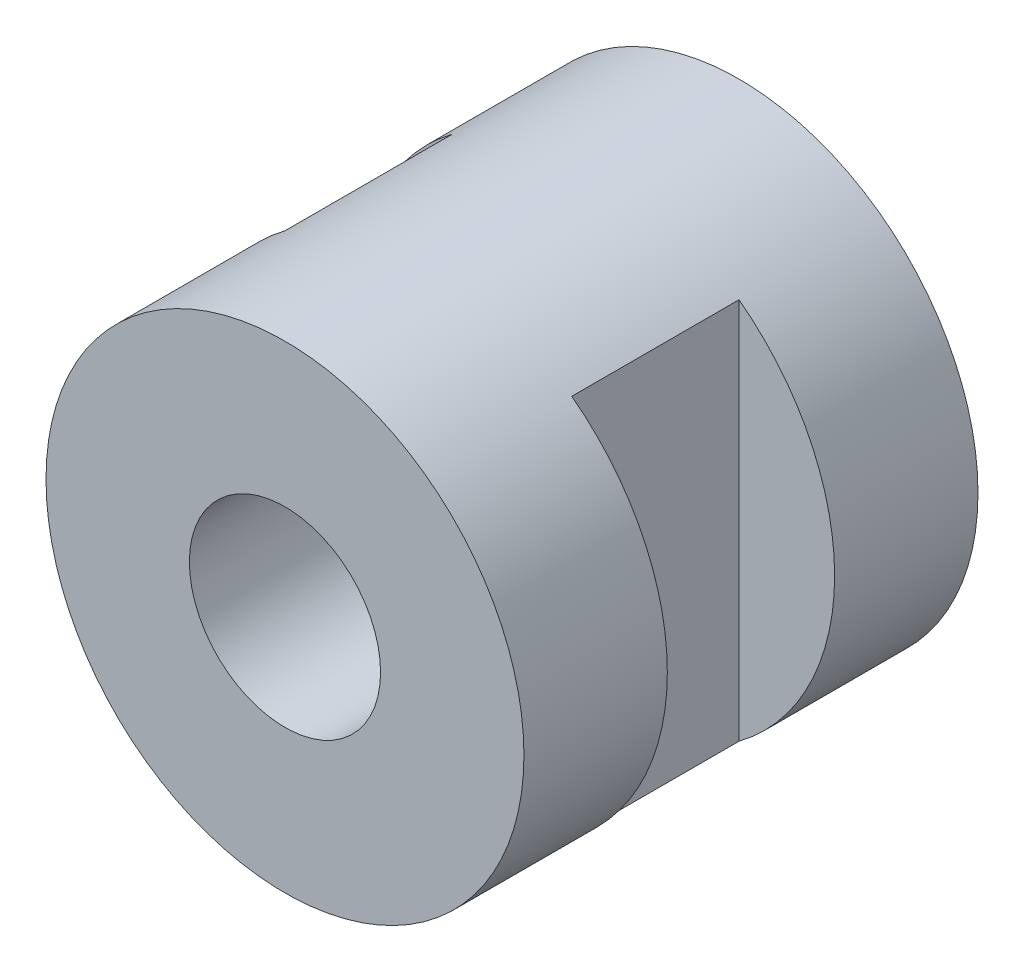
from build123d import *

# Parameters (mm, degrees)
SKETCH_1_R          = 5
EXTRUDE_1_DEPTH     = 9.5
SKETCH_2_W          = 2.383664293
SKETCH_2_H          = 3.5
CUT_EXTRUDE_1_DEPTH = 19.445866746
SKETCH_3_R          = 2
CUT_EXTRUDE_2_DEPTH = 12.842719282


with BuildPart() as part:
    # Sketch 1 → Extrude 1 (new body)
    with BuildSketch(Plane.XY):
        Circle(SKETCH_1_R)
    extrude(amount=EXTRUDE_1_DEPTH)

    # Sketch 2 → Cut-Extrude 1 (cut, through all)
    with BuildSketch(Plane(origin=(0, 10, 0), x_dir=(-1, 0, 0), z_dir=(0, 1, 0))):
        with Locations((-4.191832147, 4.75)):
            Rectangle(SKETCH_2_W, SKETCH_2_H)
        with Locations((4.191832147, 4.75)):
            Rectangle(SKETCH_2_W, SKETCH_2_H)
    extrude(amount=-CUT_EXTRUDE_1_DEPTH, mode=Mode.SUBTRACT)

    # Sketch 3 → Cut-Extrude 2 (cut, through all)
    with BuildSketch(Plane(origin=(0, 0, 0), x_dir=(-1, 0, 0), z_dir=(0, 0, -1))):
        Circle(SKETCH_3_R)
    extrude(amount=-CUT_EXTRUDE_2_DEPTH, mode=Mode.SUBTRACT)


solid = part.part
